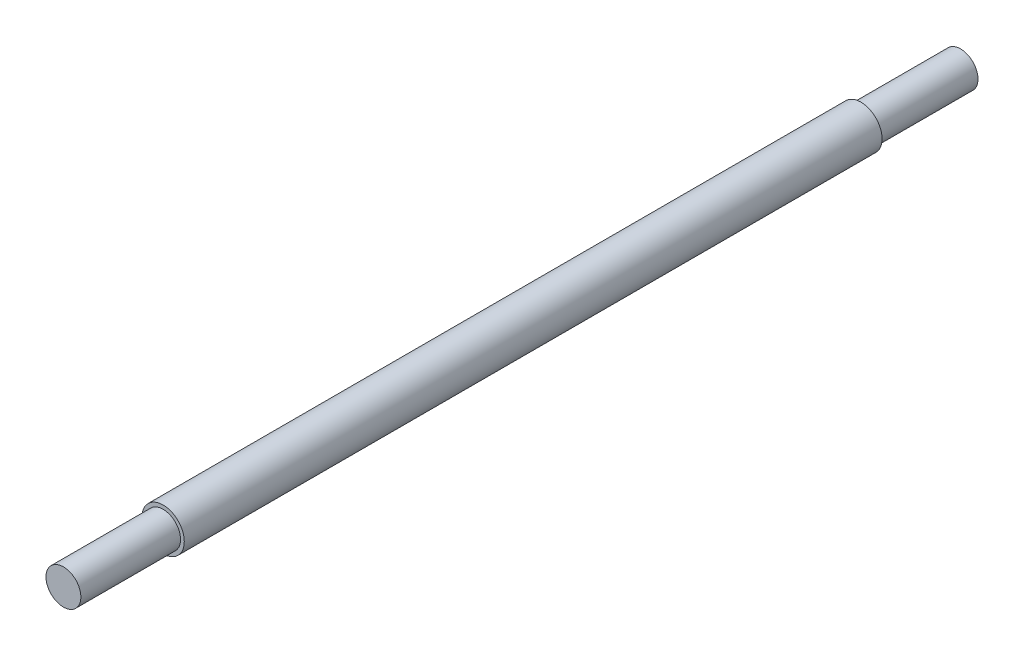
ISO-10303-21;
HEADER;
FILE_DESCRIPTION(('STEP AP214'),'2;1');
FILE_NAME('part.step','',(''),(''),'','','');
FILE_SCHEMA(('AUTOMOTIVE_DESIGN { 1 0 10303 214 1 1 1 1 }'));
ENDSEC;
DATA;
#1=APPLICATION_CONTEXT('core data for automotive mechanical design processes');
#2=APPLICATION_PROTOCOL_DEFINITION('international standard','automotive_design',2000,#1);
#3=PRODUCT_CONTEXT('',#1,'mechanical');
#4=PRODUCT('Part','Part','',(#3));
#5=PRODUCT_RELATED_PRODUCT_CATEGORY('part','',(#4));
#6=PRODUCT_DEFINITION_FORMATION('','',#4);
#7=PRODUCT_DEFINITION_CONTEXT('part definition',#1,'design');
#8=PRODUCT_DEFINITION('design','',#6,#7);
#9=PRODUCT_DEFINITION_SHAPE('','',#8);
#10=(LENGTH_UNIT() NAMED_UNIT(*) SI_UNIT(.MILLI.,.METRE.));
#11=(NAMED_UNIT(*) PLANE_ANGLE_UNIT() SI_UNIT($,.RADIAN.));
#12=(NAMED_UNIT(*) SI_UNIT($,.STERADIAN.) SOLID_ANGLE_UNIT());
#13=UNCERTAINTY_MEASURE_WITH_UNIT(LENGTH_MEASURE(1.E-05),#10,'distance_accuracy_value','');
#14=(GEOMETRIC_REPRESENTATION_CONTEXT(3) GLOBAL_UNCERTAINTY_ASSIGNED_CONTEXT((#13)) GLOBAL_UNIT_ASSIGNED_CONTEXT((#10,
#11,#12)) REPRESENTATION_CONTEXT('',''));
#15=CARTESIAN_POINT('',(0.,0.,0.));
#16=DIRECTION('',(0.,0.,1.));
#17=DIRECTION('',(1.,0.,0.));
#18=AXIS2_PLACEMENT_3D('',#15,#16,#17);
#19=CARTESIAN_POINT('',(0.,0.,700.));
#20=DIRECTION('',(0.,0.,1.));
#21=DIRECTION('',(1.,0.,0.));
#22=AXIS2_PLACEMENT_3D('',#19,#20,#21);
#23=PLANE('',#22);
#24=CARTESIAN_POINT('',(0.,0.,700.));
#25=DIRECTION('',(0.,0.,1.));
#26=DIRECTION('',(1.,0.,0.));
#27=AXIS2_PLACEMENT_3D('',#24,#25,#26);
#28=CIRCLE('',#27,42.5);
#29=CARTESIAN_POINT('',(42.5,0.,700.));
#30=VERTEX_POINT('',#29);
#31=EDGE_CURVE('E37',#30,#30,#28,.T.);
#32=ORIENTED_EDGE('',*,*,#31,.T.);
#33=EDGE_LOOP('',(#32));
#34=FACE_BOUND('',#33,.T.);
#35=CARTESIAN_POINT('',(0.,0.,700.));
#36=DIRECTION('',(0.,0.,1.));
#37=DIRECTION('',(1.,0.,0.));
#38=AXIS2_PLACEMENT_3D('',#35,#36,#37);
#39=CIRCLE('',#38,35.);
#40=CARTESIAN_POINT('',(35.,0.,700.));
#41=VERTEX_POINT('',#40);
#42=EDGE_CURVE('E46',#41,#41,#39,.F.);
#43=ORIENTED_EDGE('',*,*,#42,.T.);
#44=EDGE_LOOP('',(#43));
#45=FACE_BOUND('',#44,.T.);
#46=ADVANCED_FACE('F30',(#34,#45),#23,.T.);
#47=CARTESIAN_POINT('',(0.,0.,-700.));
#48=DIRECTION('',(0.,0.,1.));
#49=DIRECTION('',(1.,0.,0.));
#50=AXIS2_PLACEMENT_3D('',#47,#48,#49);
#51=PLANE('',#50);
#52=CARTESIAN_POINT('',(0.,0.,-700.));
#53=DIRECTION('',(0.,0.,1.));
#54=DIRECTION('',(1.,0.,0.));
#55=AXIS2_PLACEMENT_3D('',#52,#53,#54);
#56=CIRCLE('',#55,42.5);
#57=CARTESIAN_POINT('',(42.5,0.,-700.));
#58=VERTEX_POINT('',#57);
#59=EDGE_CURVE('E41',#58,#58,#56,.T.);
#60=ORIENTED_EDGE('',*,*,#59,.F.);
#61=EDGE_LOOP('',(#60));
#62=FACE_BOUND('',#61,.T.);
#63=CARTESIAN_POINT('',(0.,0.,-700.));
#64=DIRECTION('',(0.,0.,1.));
#65=DIRECTION('',(1.,0.,0.));
#66=AXIS2_PLACEMENT_3D('',#63,#64,#65);
#67=CIRCLE('',#66,35.);
#68=CARTESIAN_POINT('',(35.,0.,-700.));
#69=VERTEX_POINT('',#68);
#70=EDGE_CURVE('E10',#69,#69,#67,.F.);
#71=ORIENTED_EDGE('',*,*,#70,.F.);
#72=EDGE_LOOP('',(#71));
#73=FACE_BOUND('',#72,.T.);
#74=ADVANCED_FACE('F75',(#62,#73),#51,.F.);
#75=CARTESIAN_POINT('',(0.,0.,700.));
#76=DIRECTION('',(0.,0.,-1.));
#77=DIRECTION('',(-1.,0.,0.));
#78=AXIS2_PLACEMENT_3D('',#75,#76,#77);
#79=CYLINDRICAL_SURFACE('',#78,42.5);
#80=ORIENTED_EDGE('',*,*,#31,.F.);
#81=EDGE_LOOP('',(#80));
#82=FACE_BOUND('',#81,.T.);
#83=ORIENTED_EDGE('',*,*,#59,.T.);
#84=EDGE_LOOP('',(#83));
#85=FACE_BOUND('',#84,.T.);
#86=ADVANCED_FACE('F32',(#82,#85),#79,.T.);
#87=CARTESIAN_POINT('',(0.,0.,-900.));
#88=DIRECTION('',(0.,0.,1.));
#89=DIRECTION('',(1.,0.,0.));
#90=AXIS2_PLACEMENT_3D('',#87,#88,#89);
#91=PLANE('',#90);
#92=CARTESIAN_POINT('',(0.,0.,-900.));
#93=DIRECTION('',(0.,0.,1.));
#94=DIRECTION('',(1.,0.,0.));
#95=AXIS2_PLACEMENT_3D('',#92,#93,#94);
#96=CIRCLE('',#95,35.);
#97=CARTESIAN_POINT('',(35.,0.,-900.));
#98=VERTEX_POINT('',#97);
#99=EDGE_CURVE('E51',#98,#98,#96,.T.);
#100=ORIENTED_EDGE('',*,*,#99,.F.);
#101=EDGE_LOOP('',(#100));
#102=FACE_BOUND('',#101,.T.);
#103=ADVANCED_FACE('F69',(#102),#91,.F.);
#104=CARTESIAN_POINT('',(0.,0.,900.));
#105=DIRECTION('',(0.,0.,-1.));
#106=DIRECTION('',(-1.,0.,0.));
#107=AXIS2_PLACEMENT_3D('',#104,#105,#106);
#108=CYLINDRICAL_SURFACE('',#107,35.);
#109=ORIENTED_EDGE('',*,*,#99,.T.);
#110=EDGE_LOOP('',(#109));
#111=FACE_BOUND('',#110,.T.);
#112=ORIENTED_EDGE('',*,*,#70,.T.);
#113=EDGE_LOOP('',(#112));
#114=FACE_BOUND('',#113,.T.);
#115=ADVANCED_FACE('F61',(#111,#114),#108,.T.);
#116=ORIENTED_EDGE('',*,*,#42,.F.);
#117=EDGE_LOOP('',(#116));
#118=FACE_BOUND('',#117,.T.);
#119=CARTESIAN_POINT('',(0.,0.,900.));
#120=DIRECTION('',(0.,0.,1.));
#121=DIRECTION('',(1.,0.,0.));
#122=AXIS2_PLACEMENT_3D('',#119,#120,#121);
#123=CIRCLE('',#122,35.);
#124=CARTESIAN_POINT('',(35.,0.,900.));
#125=VERTEX_POINT('',#124);
#126=EDGE_CURVE('E50',#125,#125,#123,.T.);
#127=ORIENTED_EDGE('',*,*,#126,.F.);
#128=EDGE_LOOP('',(#127));
#129=FACE_BOUND('',#128,.T.);
#130=ADVANCED_FACE('F59',(#118,#129),#108,.T.);
#131=CARTESIAN_POINT('',(0.,0.,900.));
#132=DIRECTION('',(0.,0.,1.));
#133=DIRECTION('',(1.,0.,0.));
#134=AXIS2_PLACEMENT_3D('',#131,#132,#133);
#135=PLANE('',#134);
#136=ORIENTED_EDGE('',*,*,#126,.T.);
#137=EDGE_LOOP('',(#136));
#138=FACE_BOUND('',#137,.T.);
#139=ADVANCED_FACE('F57',(#138),#135,.T.);
#140=CLOSED_SHELL('',(#46,#74,#86,#103,#115,#130,#139));
#141=MANIFOLD_SOLID_BREP('B2',#140);
#142=ADVANCED_BREP_SHAPE_REPRESENTATION('',(#18,#141),#14);
#143=SHAPE_DEFINITION_REPRESENTATION(#9,#142);
ENDSEC;
END-ISO-10303-21;
